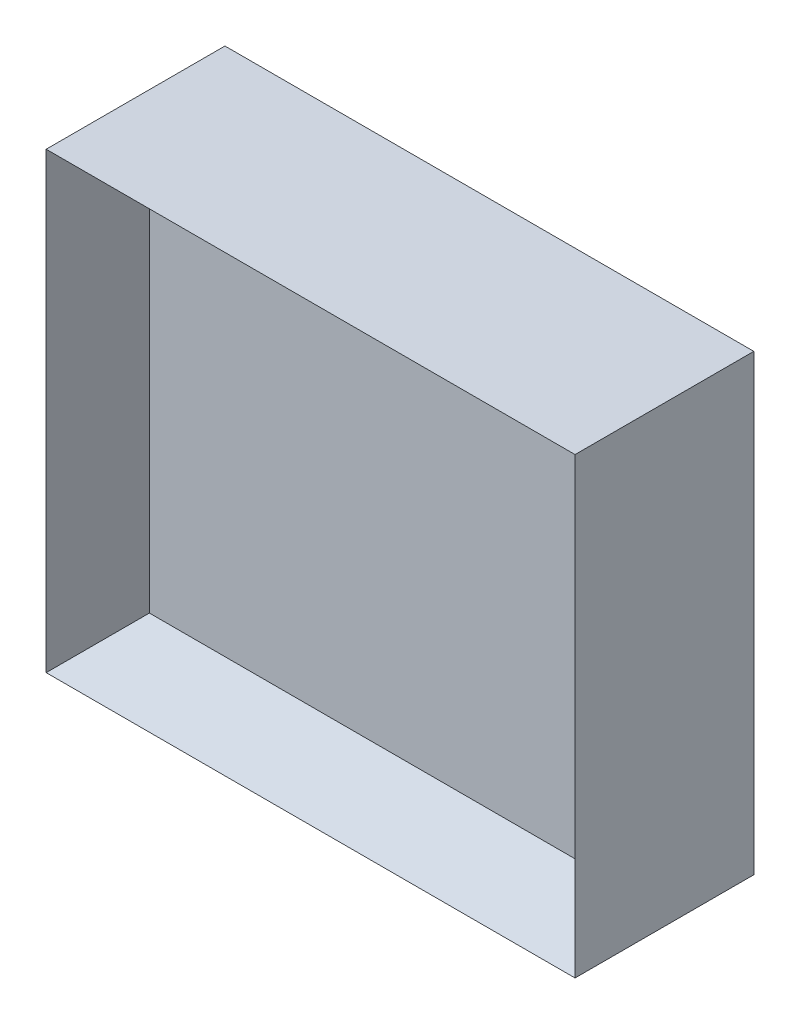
from build123d import *

# Parameters (mm, degrees)
SKETCH1_W           = 88.9
SKETCH1_H           = 76.2
BOSS_EXTRUDE1_DEPTH = 19.05
SKETCH2_W           = 76.2
SKETCH2_H           = 63.5
CUT_EXTRUDE1_DEPTH  = 30.48
CUT_EXTRUDE1_DRAFT  = -30


with BuildPart() as part:
    # Sketch1 → Boss-Extrude1 (new, symmetric)
    with BuildSketch(Plane.XY):
        Rectangle(SKETCH1_W, SKETCH1_H)
    extrude(amount=BOSS_EXTRUDE1_DEPTH, both=True)


with BuildPart() as cut_extrude1_tool:
    # Sketch2 → Cut-Extrude1 (with draft: the straight prism first)
    with BuildSketch(Plane.XY):
        Rectangle(SKETCH2_W, SKETCH2_H)
    extrude(amount=CUT_EXTRUDE1_DEPTH)
    # Cut-Extrude1: the draft: its side faces are tilted about the plane it starts from
    cut_extrude1_sides = [cut_extrude1_tool.faces().sort_by_distance(p)[0] for p in [
        (0, 31.75, 15.24),
        (-38.1, 0, 15.24),
        (0, -31.75, 15.24),
        (38.1, 0, 15.24),
    ]]
    draft(cut_extrude1_sides, Plane.XY, CUT_EXTRUDE1_DRAFT)


with BuildPart() as part_1:
    add(part.part)

    # Cut-Extrude1: cut by cut_extrude1_tool
    add(cut_extrude1_tool.part, mode=Mode.SUBTRACT)


solid = part_1.part
